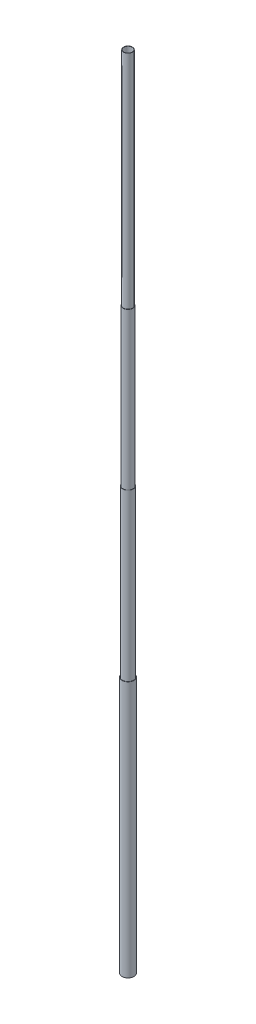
ISO-10303-21;
HEADER;
FILE_DESCRIPTION(('STEP AP214'),'2;1');
FILE_NAME('part.step','',(''),(''),'','','');
FILE_SCHEMA(('AUTOMOTIVE_DESIGN { 1 0 10303 214 1 1 1 1 }'));
ENDSEC;
DATA;
#1=APPLICATION_CONTEXT('core data for automotive mechanical design processes');
#2=APPLICATION_PROTOCOL_DEFINITION('international standard','automotive_design',2000,#1);
#3=PRODUCT_CONTEXT('',#1,'mechanical');
#4=PRODUCT('Part','Part','',(#3));
#5=PRODUCT_RELATED_PRODUCT_CATEGORY('part','',(#4));
#6=PRODUCT_DEFINITION_FORMATION('','',#4);
#7=PRODUCT_DEFINITION_CONTEXT('part definition',#1,'design');
#8=PRODUCT_DEFINITION('design','',#6,#7);
#9=PRODUCT_DEFINITION_SHAPE('','',#8);
#10=(LENGTH_UNIT() NAMED_UNIT(*) SI_UNIT(.MILLI.,.METRE.));
#11=(NAMED_UNIT(*) PLANE_ANGLE_UNIT() SI_UNIT($,.RADIAN.));
#12=(NAMED_UNIT(*) SI_UNIT($,.STERADIAN.) SOLID_ANGLE_UNIT());
#13=UNCERTAINTY_MEASURE_WITH_UNIT(LENGTH_MEASURE(1.E-05),#10,'distance_accuracy_value','');
#14=(GEOMETRIC_REPRESENTATION_CONTEXT(3) GLOBAL_UNCERTAINTY_ASSIGNED_CONTEXT((#13)) GLOBAL_UNIT_ASSIGNED_CONTEXT((#10,
#11,#12)) REPRESENTATION_CONTEXT('',''));
#15=CARTESIAN_POINT('',(0.,0.,0.));
#16=DIRECTION('',(0.,0.,1.));
#17=DIRECTION('',(1.,0.,0.));
#18=AXIS2_PLACEMENT_3D('',#15,#16,#17);
#19=CARTESIAN_POINT('',(0.,435.75,0.));
#20=DIRECTION('',(0.,1.,0.));
#21=DIRECTION('',(0.,0.,1.));
#22=AXIS2_PLACEMENT_3D('',#19,#20,#21);
#23=CYLINDRICAL_SURFACE('',#22,18.0000000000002);
#24=CARTESIAN_POINT('',(0.,2430.,0.));
#25=DIRECTION('',(0.,1.,0.));
#26=DIRECTION('',(0.,0.,1.));
#27=AXIS2_PLACEMENT_3D('',#24,#25,#26);
#28=CIRCLE('',#27,18.0000000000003);
#29=CARTESIAN_POINT('',(0.,2430.,18.0000000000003));
#30=VERTEX_POINT('',#29);
#31=EDGE_CURVE('E11',#30,#30,#28,.T.);
#32=ORIENTED_EDGE('',*,*,#31,.F.);
#33=EDGE_LOOP('',(#32));
#34=FACE_BOUND('',#33,.T.);
#35=CARTESIAN_POINT('',(0.,3430.,0.));
#36=DIRECTION('',(0.,1.,0.));
#37=DIRECTION('',(0.,0.,1.));
#38=AXIS2_PLACEMENT_3D('',#35,#36,#37);
#39=CIRCLE('',#38,18.0000000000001);
#40=CARTESIAN_POINT('',(0.,3430.,18.0000000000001));
#41=VERTEX_POINT('',#40);
#42=EDGE_CURVE('E59',#41,#41,#39,.T.);
#43=ORIENTED_EDGE('',*,*,#42,.T.);
#44=EDGE_LOOP('',(#43));
#45=FACE_BOUND('',#44,.T.);
#46=ADVANCED_FACE('F45',(#34,#45),#23,.F.);
#47=CARTESIAN_POINT('',(18.0000000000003,2430.,0.));
#48=DIRECTION('',(0.,1.,0.));
#49=DIRECTION('',(0.,0.,1.));
#50=AXIS2_PLACEMENT_3D('',#47,#48,#49);
#51=PLANE('',#50);
#52=CARTESIAN_POINT('',(0.,2430.,0.));
#53=DIRECTION('',(0.,1.,0.));
#54=DIRECTION('',(0.,0.,1.));
#55=AXIS2_PLACEMENT_3D('',#52,#53,#54);
#56=CIRCLE('',#55,19.0000000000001);
#57=CARTESIAN_POINT('',(0.,2430.,19.0000000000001));
#58=VERTEX_POINT('',#57);
#59=EDGE_CURVE('E51',#58,#58,#56,.T.);
#60=ORIENTED_EDGE('',*,*,#59,.F.);
#61=EDGE_LOOP('',(#60));
#62=FACE_BOUND('',#61,.T.);
#63=ORIENTED_EDGE('',*,*,#31,.T.);
#64=EDGE_LOOP('',(#63));
#65=FACE_BOUND('',#64,.T.);
#66=ADVANCED_FACE('F74',(#62,#65),#51,.F.);
#67=CARTESIAN_POINT('',(0.,435.75,0.));
#68=DIRECTION('',(0.,1.,0.));
#69=DIRECTION('',(0.,0.,1.));
#70=AXIS2_PLACEMENT_3D('',#67,#68,#69);
#71=CYLINDRICAL_SURFACE('',#70,19.0000000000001);
#72=CARTESIAN_POINT('',(0.,3430.,0.));
#73=DIRECTION('',(0.,1.,0.));
#74=DIRECTION('',(0.,0.,1.));
#75=AXIS2_PLACEMENT_3D('',#72,#73,#74);
#76=CIRCLE('',#75,19.);
#77=CARTESIAN_POINT('',(0.,3430.,19.));
#78=VERTEX_POINT('',#77);
#79=EDGE_CURVE('E55',#78,#78,#76,.T.);
#80=ORIENTED_EDGE('',*,*,#79,.F.);
#81=EDGE_LOOP('',(#80));
#82=FACE_BOUND('',#81,.T.);
#83=ORIENTED_EDGE('',*,*,#59,.T.);
#84=EDGE_LOOP('',(#83));
#85=FACE_BOUND('',#84,.T.);
#86=ADVANCED_FACE('F69',(#82,#85),#71,.T.);
#87=CARTESIAN_POINT('',(18.0000000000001,3430.,0.));
#88=DIRECTION('',(0.,-1.,0.));
#89=DIRECTION('',(0.,0.,-1.));
#90=AXIS2_PLACEMENT_3D('',#87,#88,#89);
#91=PLANE('',#90);
#92=ORIENTED_EDGE('',*,*,#42,.F.);
#93=EDGE_LOOP('',(#92));
#94=FACE_BOUND('',#93,.T.);
#95=ORIENTED_EDGE('',*,*,#79,.T.);
#96=EDGE_LOOP('',(#95));
#97=FACE_BOUND('',#96,.T.);
#98=ADVANCED_FACE('F66',(#94,#97),#91,.F.);
#99=CLOSED_SHELL('',(#46,#66,#86,#98));
#100=MANIFOLD_SOLID_BREP('B2_NOT_SHOWN',#99);
#101=CARTESIAN_POINT('',(0.,435.75,0.));
#102=DIRECTION('',(0.,1.,0.));
#103=DIRECTION('',(0.,0.,1.));
#104=AXIS2_PLACEMENT_3D('',#101,#102,#103);
#105=CYLINDRICAL_SURFACE('',#104,21.0000000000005);
#106=CARTESIAN_POINT('',(0.,2480.,0.));
#107=DIRECTION('',(0.,1.,0.));
#108=DIRECTION('',(0.,0.,1.));
#109=AXIS2_PLACEMENT_3D('',#106,#107,#108);
#110=CIRCLE('',#109,21.0000000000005);
#111=CARTESIAN_POINT('',(0.,2480.,21.0000000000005));
#112=VERTEX_POINT('',#111);
#113=EDGE_CURVE('E44',#112,#112,#110,.T.);
#114=ORIENTED_EDGE('',*,*,#113,.F.);
#115=EDGE_LOOP('',(#114));
#116=FACE_BOUND('',#115,.T.);
#117=CARTESIAN_POINT('',(0.,1510.,0.));
#118=DIRECTION('',(0.,1.,0.));
#119=DIRECTION('',(0.,0.,1.));
#120=AXIS2_PLACEMENT_3D('',#117,#118,#119);
#121=CIRCLE('',#120,21.0000000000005);
#122=CARTESIAN_POINT('',(0.,1510.,21.0000000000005));
#123=VERTEX_POINT('',#122);
#124=EDGE_CURVE('E128',#123,#123,#121,.T.);
#125=ORIENTED_EDGE('',*,*,#124,.T.);
#126=EDGE_LOOP('',(#125));
#127=FACE_BOUND('',#126,.T.);
#128=ADVANCED_FACE('F114',(#116,#127),#105,.T.);
#129=CARTESIAN_POINT('',(21.0000000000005,2480.,0.));
#130=DIRECTION('',(0.,-1.,0.));
#131=DIRECTION('',(0.,0.,-1.));
#132=AXIS2_PLACEMENT_3D('',#129,#130,#131);
#133=PLANE('',#132);
#134=CARTESIAN_POINT('',(0.,2480.,0.));
#135=DIRECTION('',(0.,1.,0.));
#136=DIRECTION('',(0.,0.,1.));
#137=AXIS2_PLACEMENT_3D('',#134,#135,#136);
#138=CIRCLE('',#137,20.0000000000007);
#139=CARTESIAN_POINT('',(0.,2480.,20.0000000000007));
#140=VERTEX_POINT('',#139);
#141=EDGE_CURVE('E120',#140,#140,#138,.T.);
#142=ORIENTED_EDGE('',*,*,#141,.F.);
#143=EDGE_LOOP('',(#142));
#144=FACE_BOUND('',#143,.T.);
#145=ORIENTED_EDGE('',*,*,#113,.T.);
#146=EDGE_LOOP('',(#145));
#147=FACE_BOUND('',#146,.T.);
#148=ADVANCED_FACE('F143',(#144,#147),#133,.F.);
#149=CARTESIAN_POINT('',(0.,435.75,0.));
#150=DIRECTION('',(0.,1.,0.));
#151=DIRECTION('',(0.,0.,1.));
#152=AXIS2_PLACEMENT_3D('',#149,#150,#151);
#153=CYLINDRICAL_SURFACE('',#152,20.0000000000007);
#154=CARTESIAN_POINT('',(0.,1510.,0.));
#155=DIRECTION('',(0.,1.,0.));
#156=DIRECTION('',(0.,0.,1.));
#157=AXIS2_PLACEMENT_3D('',#154,#155,#156);
#158=CIRCLE('',#157,20.0000000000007);
#159=CARTESIAN_POINT('',(0.,1510.,20.0000000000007));
#160=VERTEX_POINT('',#159);
#161=EDGE_CURVE('E124',#160,#160,#158,.T.);
#162=ORIENTED_EDGE('',*,*,#161,.F.);
#163=EDGE_LOOP('',(#162));
#164=FACE_BOUND('',#163,.T.);
#165=ORIENTED_EDGE('',*,*,#141,.T.);
#166=EDGE_LOOP('',(#165));
#167=FACE_BOUND('',#166,.T.);
#168=ADVANCED_FACE('F138',(#164,#167),#153,.F.);
#169=CARTESIAN_POINT('',(21.0000000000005,1510.,0.));
#170=DIRECTION('',(0.,1.,0.));
#171=DIRECTION('',(0.,0.,1.));
#172=AXIS2_PLACEMENT_3D('',#169,#170,#171);
#173=PLANE('',#172);
#174=ORIENTED_EDGE('',*,*,#124,.F.);
#175=EDGE_LOOP('',(#174));
#176=FACE_BOUND('',#175,.T.);
#177=ORIENTED_EDGE('',*,*,#161,.T.);
#178=EDGE_LOOP('',(#177));
#179=FACE_BOUND('',#178,.T.);
#180=ADVANCED_FACE('F135',(#176,#179),#173,.F.);
#181=CLOSED_SHELL('',(#128,#148,#168,#180));
#182=MANIFOLD_SOLID_BREP('B6',#181);
#183=CARTESIAN_POINT('',(0.,435.75,0.));
#184=DIRECTION('',(0.,1.,0.));
#185=DIRECTION('',(0.,0.,1.));
#186=AXIS2_PLACEMENT_3D('',#183,#184,#185);
#187=CYLINDRICAL_SURFACE('',#186,23.);
#188=CARTESIAN_POINT('',(0.,1810.,0.));
#189=DIRECTION('',(0.,1.,0.));
#190=DIRECTION('',(0.,0.,1.));
#191=AXIS2_PLACEMENT_3D('',#188,#189,#190);
#192=CIRCLE('',#191,23.);
#193=CARTESIAN_POINT('',(0.,1810.,23.));
#194=VERTEX_POINT('',#193);
#195=EDGE_CURVE('E113',#194,#194,#192,.T.);
#196=ORIENTED_EDGE('',*,*,#195,.F.);
#197=EDGE_LOOP('',(#196));
#198=FACE_BOUND('',#197,.T.);
#199=CARTESIAN_POINT('',(0.,800.,0.));
#200=DIRECTION('',(0.,1.,0.));
#201=DIRECTION('',(0.,0.,1.));
#202=AXIS2_PLACEMENT_3D('',#199,#200,#201);
#203=CIRCLE('',#202,23.);
#204=CARTESIAN_POINT('',(0.,800.,23.));
#205=VERTEX_POINT('',#204);
#206=EDGE_CURVE('E196',#205,#205,#203,.T.);
#207=ORIENTED_EDGE('',*,*,#206,.T.);
#208=EDGE_LOOP('',(#207));
#209=FACE_BOUND('',#208,.T.);
#210=ADVANCED_FACE('F182',(#198,#209),#187,.T.);
#211=CARTESIAN_POINT('',(23.,1810.,0.));
#212=DIRECTION('',(0.,-1.,0.));
#213=DIRECTION('',(0.,0.,-1.));
#214=AXIS2_PLACEMENT_3D('',#211,#212,#213);
#215=PLANE('',#214);
#216=CARTESIAN_POINT('',(0.,1810.,0.));
#217=DIRECTION('',(0.,1.,0.));
#218=DIRECTION('',(0.,0.,1.));
#219=AXIS2_PLACEMENT_3D('',#216,#217,#218);
#220=CIRCLE('',#219,22.0000000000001);
#221=CARTESIAN_POINT('',(0.,1810.,22.0000000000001));
#222=VERTEX_POINT('',#221);
#223=EDGE_CURVE('E188',#222,#222,#220,.T.);
#224=ORIENTED_EDGE('',*,*,#223,.F.);
#225=EDGE_LOOP('',(#224));
#226=FACE_BOUND('',#225,.T.);
#227=ORIENTED_EDGE('',*,*,#195,.T.);
#228=EDGE_LOOP('',(#227));
#229=FACE_BOUND('',#228,.T.);
#230=ADVANCED_FACE('F211',(#226,#229),#215,.F.);
#231=CARTESIAN_POINT('',(0.,435.75,0.));
#232=DIRECTION('',(0.,1.,0.));
#233=DIRECTION('',(0.,0.,1.));
#234=AXIS2_PLACEMENT_3D('',#231,#232,#233);
#235=CYLINDRICAL_SURFACE('',#234,22.0000000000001);
#236=CARTESIAN_POINT('',(0.,800.,0.));
#237=DIRECTION('',(0.,1.,0.));
#238=DIRECTION('',(0.,0.,1.));
#239=AXIS2_PLACEMENT_3D('',#236,#237,#238);
#240=CIRCLE('',#239,22.0000000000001);
#241=CARTESIAN_POINT('',(0.,800.,22.0000000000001));
#242=VERTEX_POINT('',#241);
#243=EDGE_CURVE('E192',#242,#242,#240,.T.);
#244=ORIENTED_EDGE('',*,*,#243,.F.);
#245=EDGE_LOOP('',(#244));
#246=FACE_BOUND('',#245,.T.);
#247=ORIENTED_EDGE('',*,*,#223,.T.);
#248=EDGE_LOOP('',(#247));
#249=FACE_BOUND('',#248,.T.);
#250=ADVANCED_FACE('F206',(#246,#249),#235,.F.);
#251=CARTESIAN_POINT('',(23.,800.,0.));
#252=DIRECTION('',(0.,1.,0.));
#253=DIRECTION('',(0.,0.,1.));
#254=AXIS2_PLACEMENT_3D('',#251,#252,#253);
#255=PLANE('',#254);
#256=ORIENTED_EDGE('',*,*,#206,.F.);
#257=EDGE_LOOP('',(#256));
#258=FACE_BOUND('',#257,.T.);
#259=ORIENTED_EDGE('',*,*,#243,.T.);
#260=EDGE_LOOP('',(#259));
#261=FACE_BOUND('',#260,.T.);
#262=ADVANCED_FACE('F203',(#258,#261),#255,.F.);
#263=CLOSED_SHELL('',(#210,#230,#250,#262));
#264=MANIFOLD_SOLID_BREP('B39',#263);
#265=CARTESIAN_POINT('',(0.,435.75,0.));
#266=DIRECTION('',(0.,1.,0.));
#267=DIRECTION('',(0.,0.,1.));
#268=AXIS2_PLACEMENT_3D('',#265,#266,#267);
#269=CYLINDRICAL_SURFACE('',#268,25.5);
#270=CARTESIAN_POINT('',(0.,1100.,0.));
#271=DIRECTION('',(0.,1.,0.));
#272=DIRECTION('',(0.,0.,1.));
#273=AXIS2_PLACEMENT_3D('',#270,#271,#272);
#274=CIRCLE('',#273,25.5);
#275=CARTESIAN_POINT('',(0.,1100.,25.5));
#276=VERTEX_POINT('',#275);
#277=EDGE_CURVE('E262',#276,#276,#274,.T.);
#278=ORIENTED_EDGE('',*,*,#277,.F.);
#279=EDGE_LOOP('',(#278));
#280=FACE_BOUND('',#279,.T.);
#281=CARTESIAN_POINT('',(0.,0.,0.));
#282=DIRECTION('',(0.,1.,0.));
#283=DIRECTION('',(0.,0.,1.));
#284=AXIS2_PLACEMENT_3D('',#281,#282,#283);
#285=CIRCLE('',#284,25.5);
#286=CARTESIAN_POINT('',(0.,0.,25.5));
#287=VERTEX_POINT('',#286);
#288=EDGE_CURVE('E181',#287,#287,#285,.T.);
#289=ORIENTED_EDGE('',*,*,#288,.T.);
#290=EDGE_LOOP('',(#289));
#291=FACE_BOUND('',#290,.T.);
#292=ADVANCED_FACE('F245',(#280,#291),#269,.T.);
#293=CARTESIAN_POINT('',(24.4,0.,0.));
#294=DIRECTION('',(0.,1.,0.));
#295=DIRECTION('',(0.,0.,1.));
#296=AXIS2_PLACEMENT_3D('',#293,#294,#295);
#297=PLANE('',#296);
#298=ORIENTED_EDGE('',*,*,#288,.F.);
#299=EDGE_LOOP('',(#298));
#300=FACE_BOUND('',#299,.T.);
#301=CARTESIAN_POINT('',(0.,0.,0.));
#302=DIRECTION('',(0.,1.,0.));
#303=DIRECTION('',(0.,0.,1.));
#304=AXIS2_PLACEMENT_3D('',#301,#302,#303);
#305=CIRCLE('',#304,24.4);
#306=CARTESIAN_POINT('',(0.,0.,24.4));
#307=VERTEX_POINT('',#306);
#308=EDGE_CURVE('E252',#307,#307,#305,.T.);
#309=ORIENTED_EDGE('',*,*,#308,.T.);
#310=EDGE_LOOP('',(#309));
#311=FACE_BOUND('',#310,.T.);
#312=ADVANCED_FACE('F272',(#300,#311),#297,.F.);
#313=CARTESIAN_POINT('',(0.,435.75,0.));
#314=DIRECTION('',(0.,1.,0.));
#315=DIRECTION('',(0.,0.,1.));
#316=AXIS2_PLACEMENT_3D('',#313,#314,#315);
#317=CYLINDRICAL_SURFACE('',#316,24.4);
#318=ORIENTED_EDGE('',*,*,#308,.F.);
#319=EDGE_LOOP('',(#318));
#320=FACE_BOUND('',#319,.T.);
#321=CARTESIAN_POINT('',(0.,1100.,0.));
#322=DIRECTION('',(0.,1.,0.));
#323=DIRECTION('',(0.,0.,1.));
#324=AXIS2_PLACEMENT_3D('',#321,#322,#323);
#325=CIRCLE('',#324,24.4);
#326=CARTESIAN_POINT('',(0.,1100.,24.4));
#327=VERTEX_POINT('',#326);
#328=EDGE_CURVE('E257',#327,#327,#325,.T.);
#329=ORIENTED_EDGE('',*,*,#328,.T.);
#330=EDGE_LOOP('',(#329));
#331=FACE_BOUND('',#330,.T.);
#332=ADVANCED_FACE('F276',(#320,#331),#317,.F.);
#333=CARTESIAN_POINT('',(24.4,1100.,0.));
#334=DIRECTION('',(0.,-1.,0.));
#335=DIRECTION('',(0.,0.,-1.));
#336=AXIS2_PLACEMENT_3D('',#333,#334,#335);
#337=PLANE('',#336);
#338=ORIENTED_EDGE('',*,*,#328,.F.);
#339=EDGE_LOOP('',(#338));
#340=FACE_BOUND('',#339,.T.);
#341=ORIENTED_EDGE('',*,*,#277,.T.);
#342=EDGE_LOOP('',(#341));
#343=FACE_BOUND('',#342,.T.);
#344=ADVANCED_FACE('F269',(#340,#343),#337,.F.);
#345=CLOSED_SHELL('',(#292,#312,#332,#344));
#346=MANIFOLD_SOLID_BREP('B108',#345);
#347=ADVANCED_BREP_SHAPE_REPRESENTATION('',(#18,#100,#182,#264,#346),#14);
#348=SHAPE_DEFINITION_REPRESENTATION(#9,#347);
ENDSEC;
END-ISO-10303-21;
